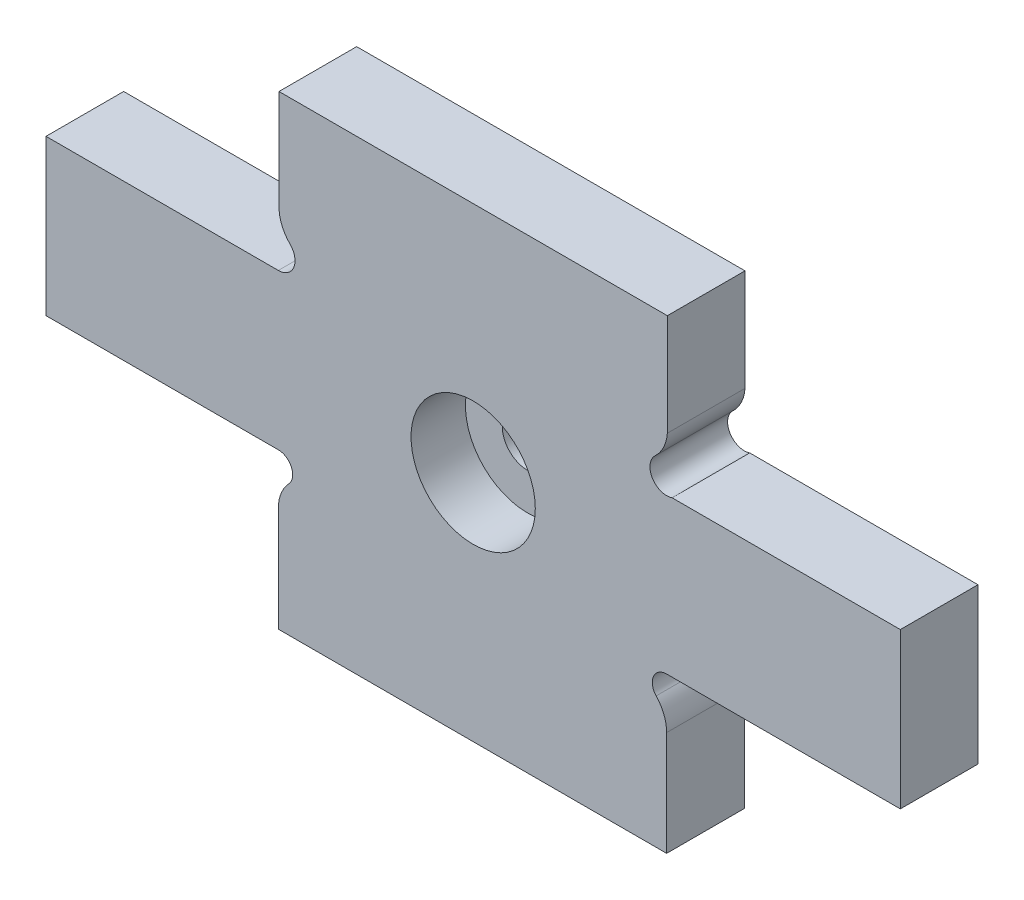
ISO-10303-21;
HEADER;
FILE_DESCRIPTION(('STEP AP214'),'2;1');
FILE_NAME('part.step','',(''),(''),'','','');
FILE_SCHEMA(('AUTOMOTIVE_DESIGN { 1 0 10303 214 1 1 1 1 }'));
ENDSEC;
DATA;
#1=APPLICATION_CONTEXT('core data for automotive mechanical design processes');
#2=APPLICATION_PROTOCOL_DEFINITION('international standard','automotive_design',2000,#1);
#3=PRODUCT_CONTEXT('',#1,'mechanical');
#4=PRODUCT('Part','Part','',(#3));
#5=PRODUCT_RELATED_PRODUCT_CATEGORY('part','',(#4));
#6=PRODUCT_DEFINITION_FORMATION('','',#4);
#7=PRODUCT_DEFINITION_CONTEXT('part definition',#1,'design');
#8=PRODUCT_DEFINITION('design','',#6,#7);
#9=PRODUCT_DEFINITION_SHAPE('','',#8);
#10=(LENGTH_UNIT() NAMED_UNIT(*) SI_UNIT(.MILLI.,.METRE.));
#11=(NAMED_UNIT(*) PLANE_ANGLE_UNIT() SI_UNIT($,.RADIAN.));
#12=(NAMED_UNIT(*) SI_UNIT($,.STERADIAN.) SOLID_ANGLE_UNIT());
#13=UNCERTAINTY_MEASURE_WITH_UNIT(LENGTH_MEASURE(1.E-05),#10,'distance_accuracy_value','');
#14=(GEOMETRIC_REPRESENTATION_CONTEXT(3) GLOBAL_UNCERTAINTY_ASSIGNED_CONTEXT((#13)) GLOBAL_UNIT_ASSIGNED_CONTEXT((#10,
#11,#12)) REPRESENTATION_CONTEXT('',''));
#15=CARTESIAN_POINT('',(0.,0.,0.));
#16=DIRECTION('',(0.,0.,1.));
#17=DIRECTION('',(1.,0.,0.));
#18=AXIS2_PLACEMENT_3D('',#15,#16,#17);
#19=CARTESIAN_POINT('',(0.,0.,10.));
#20=DIRECTION('',(0.,0.,-1.));
#21=DIRECTION('',(-1.,0.,0.));
#22=AXIS2_PLACEMENT_3D('',#19,#20,#21);
#23=CYLINDRICAL_SURFACE('',#22,3.25);
#24=CARTESIAN_POINT('',(0.,0.,0.));
#25=DIRECTION('',(0.,0.,1.));
#26=DIRECTION('',(1.,0.,0.));
#27=AXIS2_PLACEMENT_3D('',#24,#25,#26);
#28=CIRCLE('',#27,3.25);
#29=CARTESIAN_POINT('',(3.25,0.,0.));
#30=VERTEX_POINT('',#29);
#31=EDGE_CURVE('E225',#30,#30,#28,.T.);
#32=ORIENTED_EDGE('',*,*,#31,.F.);
#33=EDGE_LOOP('',(#32));
#34=FACE_BOUND('',#33,.T.);
#35=CARTESIAN_POINT('',(0.,0.,3.));
#36=DIRECTION('',(0.,0.,1.));
#37=DIRECTION('',(1.,0.,0.));
#38=AXIS2_PLACEMENT_3D('',#35,#36,#37);
#39=CIRCLE('',#38,3.25);
#40=CARTESIAN_POINT('',(3.25,0.,3.));
#41=VERTEX_POINT('',#40);
#42=EDGE_CURVE('E49',#41,#41,#39,.T.);
#43=ORIENTED_EDGE('',*,*,#42,.T.);
#44=EDGE_LOOP('',(#43));
#45=FACE_BOUND('',#44,.T.);
#46=ADVANCED_FACE('F45',(#34,#45),#23,.F.);
#47=CARTESIAN_POINT('',(19.9125190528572,-16.5321469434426,10.));
#48=DIRECTION('',(0.,0.,-1.));
#49=DIRECTION('',(-1.,0.,0.));
#50=AXIS2_PLACEMENT_3D('',#47,#48,#49);
#51=CYLINDRICAL_SURFACE('',#50,4.99999999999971);
#52=CARTESIAN_POINT('',(19.9125190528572,-16.5321469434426,0.));
#53=DIRECTION('',(0.,0.,1.));
#54=DIRECTION('',(1.,0.,0.));
#55=AXIS2_PLACEMENT_3D('',#52,#53,#54);
#56=CIRCLE('',#55,4.99999999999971);
#57=CARTESIAN_POINT('',(24.9125190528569,-16.5321469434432,0.));
#58=VERTEX_POINT('',#57);
#59=CARTESIAN_POINT('',(23.5621540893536,-13.1145214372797,0.));
#60=VERTEX_POINT('',#59);
#61=EDGE_CURVE('E220',#58,#60,#56,.T.);
#62=ORIENTED_EDGE('',*,*,#61,.T.);
#63=DIRECTION('',(0.,0.,-1.));
#64=VECTOR('',#63,1.);
#65=CARTESIAN_POINT('',(23.5621540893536,-13.1145214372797,10.));
#66=LINE('',#65,#64);
#67=CARTESIAN_POINT('',(23.5621540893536,-13.1145214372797,10.));
#68=VERTEX_POINT('',#67);
#69=EDGE_CURVE('E11',#68,#60,#66,.T.);
#70=ORIENTED_EDGE('',*,*,#69,.F.);
#71=CARTESIAN_POINT('',(19.9125190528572,-16.5321469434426,10.));
#72=DIRECTION('',(0.,0.,1.));
#73=DIRECTION('',(1.,0.,0.));
#74=AXIS2_PLACEMENT_3D('',#71,#72,#73);
#75=CIRCLE('',#74,4.99999999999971);
#76=CARTESIAN_POINT('',(24.9125190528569,-16.5321469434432,10.));
#77=VERTEX_POINT('',#76);
#78=EDGE_CURVE('E279',#77,#68,#75,.T.);
#79=ORIENTED_EDGE('',*,*,#78,.F.);
#80=DIRECTION('',(0.,0.,-1.));
#81=VECTOR('',#80,1.);
#82=CARTESIAN_POINT('',(24.9125190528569,-16.5321469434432,10.));
#83=LINE('',#82,#81);
#84=EDGE_CURVE('E216',#77,#58,#83,.T.);
#85=ORIENTED_EDGE('',*,*,#84,.T.);
#86=EDGE_LOOP('',(#62,#70,#79,#85));
#87=FACE_BOUND('',#86,.T.);
#88=ADVANCED_FACE('F47',(#87),#51,.T.);
#89=CARTESIAN_POINT('',(24.9125190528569,-11.8499999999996,10.));
#90=DIRECTION('',(0.,0.,-1.));
#91=DIRECTION('',(-1.,0.,0.));
#92=AXIS2_PLACEMENT_3D('',#89,#90,#91);
#93=CYLINDRICAL_SURFACE('',#92,1.84999999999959);
#94=CARTESIAN_POINT('',(24.9125190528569,-11.8499999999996,0.));
#95=DIRECTION('',(0.,0.,-1.));
#96=DIRECTION('',(1.,0.,0.));
#97=AXIS2_PLACEMENT_3D('',#94,#95,#96);
#98=CIRCLE('',#97,1.84999999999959);
#99=CARTESIAN_POINT('',(24.9125190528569,-10.,0.));
#100=VERTEX_POINT('',#99);
#101=EDGE_CURVE('E224',#60,#100,#98,.T.);
#102=ORIENTED_EDGE('',*,*,#101,.T.);
#103=DIRECTION('',(0.,0.,-1.));
#104=VECTOR('',#103,1.);
#105=CARTESIAN_POINT('',(24.9125190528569,-10.,10.));
#106=LINE('',#105,#104);
#107=CARTESIAN_POINT('',(24.9125190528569,-10.,10.));
#108=VERTEX_POINT('',#107);
#109=EDGE_CURVE('E56',#108,#100,#106,.T.);
#110=ORIENTED_EDGE('',*,*,#109,.F.);
#111=CARTESIAN_POINT('',(24.9125190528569,-11.8499999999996,10.));
#112=DIRECTION('',(0.,0.,-1.));
#113=DIRECTION('',(1.,0.,0.));
#114=AXIS2_PLACEMENT_3D('',#111,#112,#113);
#115=CIRCLE('',#114,1.84999999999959);
#116=EDGE_CURVE('E143',#68,#108,#115,.T.);
#117=ORIENTED_EDGE('',*,*,#116,.F.);
#118=ORIENTED_EDGE('',*,*,#69,.T.);
#119=EDGE_LOOP('',(#102,#110,#117,#118));
#120=FACE_BOUND('',#119,.T.);
#121=ADVANCED_FACE('F437',(#120),#93,.F.);
#122=CARTESIAN_POINT('',(24.9125190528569,-10.,10.));
#123=DIRECTION('',(0.,1.,0.));
#124=DIRECTION('',(-1.,0.,0.));
#125=AXIS2_PLACEMENT_3D('',#122,#123,#124);
#126=PLANE('',#125);
#127=DIRECTION('',(1.,0.,0.));
#128=VECTOR('',#127,1.);
#129=CARTESIAN_POINT('',(24.9125190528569,-10.,0.));
#130=LINE('',#129,#128);
#131=CARTESIAN_POINT('',(55.0000000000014,-9.99999999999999,0.));
#132=VERTEX_POINT('',#131);
#133=EDGE_CURVE('E228',#100,#132,#130,.T.);
#134=ORIENTED_EDGE('',*,*,#133,.T.);
#135=DIRECTION('',(0.,0.,-1.));
#136=VECTOR('',#135,1.);
#137=CARTESIAN_POINT('',(55.0000000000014,-9.99999999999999,10.));
#138=LINE('',#137,#136);
#139=CARTESIAN_POINT('',(55.0000000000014,-9.99999999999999,10.));
#140=VERTEX_POINT('',#139);
#141=EDGE_CURVE('E338',#140,#132,#138,.T.);
#142=ORIENTED_EDGE('',*,*,#141,.F.);
#143=DIRECTION('',(1.,0.,0.));
#144=VECTOR('',#143,1.);
#145=CARTESIAN_POINT('',(24.9125190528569,-10.,10.));
#146=LINE('',#145,#144);
#147=EDGE_CURVE('E349',#108,#140,#146,.T.);
#148=ORIENTED_EDGE('',*,*,#147,.F.);
#149=ORIENTED_EDGE('',*,*,#109,.T.);
#150=EDGE_LOOP('',(#134,#142,#148,#149));
#151=FACE_BOUND('',#150,.T.);
#152=ADVANCED_FACE('F347',(#151),#126,.F.);
#153=CARTESIAN_POINT('',(55.0000000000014,-9.99999999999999,10.));
#154=DIRECTION('',(-1.,0.,0.));
#155=DIRECTION('',(0.,-1.,0.));
#156=AXIS2_PLACEMENT_3D('',#153,#154,#155);
#157=PLANE('',#156);
#158=DIRECTION('',(0.,1.,0.));
#159=VECTOR('',#158,1.);
#160=CARTESIAN_POINT('',(55.0000000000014,-9.99999999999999,0.));
#161=LINE('',#160,#159);
#162=CARTESIAN_POINT('',(55.0000000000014,10.,0.));
#163=VERTEX_POINT('',#162);
#164=EDGE_CURVE('E231',#132,#163,#161,.T.);
#165=ORIENTED_EDGE('',*,*,#164,.T.);
#166=DIRECTION('',(0.,0.,-1.));
#167=VECTOR('',#166,1.);
#168=CARTESIAN_POINT('',(55.0000000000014,10.,10.));
#169=LINE('',#168,#167);
#170=CARTESIAN_POINT('',(55.0000000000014,10.,10.));
#171=VERTEX_POINT('',#170);
#172=EDGE_CURVE('E334',#171,#163,#169,.T.);
#173=ORIENTED_EDGE('',*,*,#172,.F.);
#174=DIRECTION('',(0.,1.,0.));
#175=VECTOR('',#174,1.);
#176=CARTESIAN_POINT('',(55.0000000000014,-9.99999999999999,10.));
#177=LINE('',#176,#175);
#178=EDGE_CURVE('E368',#140,#171,#177,.T.);
#179=ORIENTED_EDGE('',*,*,#178,.F.);
#180=ORIENTED_EDGE('',*,*,#141,.T.);
#181=EDGE_LOOP('',(#165,#173,#179,#180));
#182=FACE_BOUND('',#181,.T.);
#183=ADVANCED_FACE('F358',(#182),#157,.F.);
#184=CARTESIAN_POINT('',(55.0000000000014,10.,10.));
#185=DIRECTION('',(0.,-1.,0.));
#186=DIRECTION('',(1.,0.,0.));
#187=AXIS2_PLACEMENT_3D('',#184,#185,#186);
#188=PLANE('',#187);
#189=DIRECTION('',(-1.,0.,0.));
#190=VECTOR('',#189,1.);
#191=CARTESIAN_POINT('',(55.0000000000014,10.,0.));
#192=LINE('',#191,#190);
#193=CARTESIAN_POINT('',(25.6054544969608,10.,0.));
#194=VERTEX_POINT('',#193);
#195=EDGE_CURVE('E234',#163,#194,#192,.T.);
#196=ORIENTED_EDGE('',*,*,#195,.T.);
#197=DIRECTION('',(0.,0.,-1.));
#198=VECTOR('',#197,1.);
#199=CARTESIAN_POINT('',(25.6054544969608,10.,10.));
#200=LINE('',#199,#198);
#201=CARTESIAN_POINT('',(25.6054544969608,10.,10.));
#202=VERTEX_POINT('',#201);
#203=EDGE_CURVE('E330',#202,#194,#200,.T.);
#204=ORIENTED_EDGE('',*,*,#203,.F.);
#205=DIRECTION('',(-1.,0.,0.));
#206=VECTOR('',#205,1.);
#207=CARTESIAN_POINT('',(55.0000000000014,10.,10.));
#208=LINE('',#207,#206);
#209=EDGE_CURVE('E364',#171,#202,#208,.T.);
#210=ORIENTED_EDGE('',*,*,#209,.F.);
#211=ORIENTED_EDGE('',*,*,#172,.T.);
#212=EDGE_LOOP('',(#196,#204,#210,#211));
#213=FACE_BOUND('',#212,.T.);
#214=ADVANCED_FACE('F362',(#213),#188,.F.);
#215=CARTESIAN_POINT('',(24.9125190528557,12.0392494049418,10.));
#216=DIRECTION('',(0.,0.,-1.));
#217=DIRECTION('',(-1.,0.,0.));
#218=AXIS2_PLACEMENT_3D('',#215,#216,#217);
#219=CYLINDRICAL_SURFACE('',#218,2.15376360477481);
#220=CARTESIAN_POINT('',(24.9125190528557,12.0392494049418,0.));
#221=DIRECTION('',(0.,0.,-1.));
#222=DIRECTION('',(1.,0.,0.));
#223=AXIS2_PLACEMENT_3D('',#220,#221,#222);
#224=CIRCLE('',#223,2.15376360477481);
#225=CARTESIAN_POINT('',(23.4920014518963,13.658146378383,0.));
#226=VERTEX_POINT('',#225);
#227=EDGE_CURVE('E237',#194,#226,#224,.T.);
#228=ORIENTED_EDGE('',*,*,#227,.T.);
#229=DIRECTION('',(0.,0.,-1.));
#230=VECTOR('',#229,1.);
#231=CARTESIAN_POINT('',(23.4920014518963,13.658146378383,10.));
#232=LINE('',#231,#230);
#233=CARTESIAN_POINT('',(23.4920014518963,13.658146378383,10.));
#234=VERTEX_POINT('',#233);
#235=EDGE_CURVE('E326',#234,#226,#232,.T.);
#236=ORIENTED_EDGE('',*,*,#235,.F.);
#237=CARTESIAN_POINT('',(24.9125190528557,12.0392494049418,10.));
#238=DIRECTION('',(0.,0.,-1.));
#239=DIRECTION('',(1.,0.,0.));
#240=AXIS2_PLACEMENT_3D('',#237,#238,#239);
#241=CIRCLE('',#240,2.15376360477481);
#242=EDGE_CURVE('E367',#202,#234,#241,.T.);
#243=ORIENTED_EDGE('',*,*,#242,.F.);
#244=ORIENTED_EDGE('',*,*,#203,.T.);
#245=EDGE_LOOP('',(#228,#236,#243,#244));
#246=FACE_BOUND('',#245,.T.);
#247=ADVANCED_FACE('F621',(#246),#219,.F.);
#248=CARTESIAN_POINT('',(20.0124530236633,17.2487929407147,10.));
#249=DIRECTION('',(0.,0.,-1.));
#250=DIRECTION('',(-1.,0.,0.));
#251=AXIS2_PLACEMENT_3D('',#248,#249,#250);
#252=CYLINDRICAL_SURFACE('',#251,5.00000000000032);
#253=CARTESIAN_POINT('',(20.0124530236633,17.2487929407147,0.));
#254=DIRECTION('',(0.,0.,1.));
#255=DIRECTION('',(1.,0.,0.));
#256=AXIS2_PLACEMENT_3D('',#253,#254,#255);
#257=CIRCLE('',#256,5.00000000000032);
#258=CARTESIAN_POINT('',(25.0000000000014,16.8961243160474,0.));
#259=VERTEX_POINT('',#258);
#260=EDGE_CURVE('E240',#226,#259,#257,.T.);
#261=ORIENTED_EDGE('',*,*,#260,.T.);
#262=DIRECTION('',(0.,0.,-1.));
#263=VECTOR('',#262,1.);
#264=CARTESIAN_POINT('',(25.0000000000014,16.8961243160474,10.));
#265=LINE('',#264,#263);
#266=CARTESIAN_POINT('',(25.0000000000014,16.8961243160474,10.));
#267=VERTEX_POINT('',#266);
#268=EDGE_CURVE('E322',#267,#259,#265,.T.);
#269=ORIENTED_EDGE('',*,*,#268,.F.);
#270=CARTESIAN_POINT('',(20.0124530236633,17.2487929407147,10.));
#271=DIRECTION('',(0.,0.,1.));
#272=DIRECTION('',(1.,0.,0.));
#273=AXIS2_PLACEMENT_3D('',#270,#271,#272);
#274=CIRCLE('',#273,5.00000000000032);
#275=EDGE_CURVE('E372',#234,#267,#274,.T.);
#276=ORIENTED_EDGE('',*,*,#275,.F.);
#277=ORIENTED_EDGE('',*,*,#235,.T.);
#278=EDGE_LOOP('',(#261,#269,#276,#277));
#279=FACE_BOUND('',#278,.T.);
#280=ADVANCED_FACE('F611',(#279),#252,.T.);
#281=CARTESIAN_POINT('',(25.0000000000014,16.8961243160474,10.));
#282=DIRECTION('',(-1.,0.,0.));
#283=DIRECTION('',(0.,0.,1.));
#284=AXIS2_PLACEMENT_3D('',#281,#282,#283);
#285=PLANE('',#284);
#286=DIRECTION('',(0.,1.,0.));
#287=VECTOR('',#286,1.);
#288=CARTESIAN_POINT('',(25.0000000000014,16.8961243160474,0.));
#289=LINE('',#288,#287);
#290=CARTESIAN_POINT('',(25.0000000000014,30.,0.));
#291=VERTEX_POINT('',#290);
#292=EDGE_CURVE('E243',#259,#291,#289,.T.);
#293=ORIENTED_EDGE('',*,*,#292,.T.);
#294=DIRECTION('',(0.,0.,-1.));
#295=VECTOR('',#294,1.);
#296=CARTESIAN_POINT('',(25.0000000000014,30.,10.));
#297=LINE('',#296,#295);
#298=CARTESIAN_POINT('',(25.0000000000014,30.,10.));
#299=VERTEX_POINT('',#298);
#300=EDGE_CURVE('E318',#299,#291,#297,.T.);
#301=ORIENTED_EDGE('',*,*,#300,.F.);
#302=DIRECTION('',(0.,1.,0.));
#303=VECTOR('',#302,1.);
#304=CARTESIAN_POINT('',(25.0000000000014,16.8961243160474,10.));
#305=LINE('',#304,#303);
#306=EDGE_CURVE('E379',#267,#299,#305,.T.);
#307=ORIENTED_EDGE('',*,*,#306,.F.);
#308=ORIENTED_EDGE('',*,*,#268,.T.);
#309=EDGE_LOOP('',(#293,#301,#307,#308));
#310=FACE_BOUND('',#309,.T.);
#311=ADVANCED_FACE('F601',(#310),#285,.F.);
#312=CARTESIAN_POINT('',(25.0000000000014,30.,10.));
#313=DIRECTION('',(0.,-1.,0.));
#314=DIRECTION('',(1.,0.,0.));
#315=AXIS2_PLACEMENT_3D('',#312,#313,#314);
#316=PLANE('',#315);
#317=DIRECTION('',(-1.,0.,0.));
#318=VECTOR('',#317,1.);
#319=CARTESIAN_POINT('',(25.0000000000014,30.,0.));
#320=LINE('',#319,#318);
#321=CARTESIAN_POINT('',(-25.,30.,0.));
#322=VERTEX_POINT('',#321);
#323=EDGE_CURVE('E246',#291,#322,#320,.T.);
#324=ORIENTED_EDGE('',*,*,#323,.T.);
#325=DIRECTION('',(0.,0.,-1.));
#326=VECTOR('',#325,1.);
#327=CARTESIAN_POINT('',(-25.,30.,10.));
#328=LINE('',#327,#326);
#329=CARTESIAN_POINT('',(-25.,30.,10.));
#330=VERTEX_POINT('',#329);
#331=EDGE_CURVE('E314',#330,#322,#328,.T.);
#332=ORIENTED_EDGE('',*,*,#331,.F.);
#333=DIRECTION('',(-1.,0.,0.));
#334=VECTOR('',#333,1.);
#335=CARTESIAN_POINT('',(25.0000000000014,30.,10.));
#336=LINE('',#335,#334);
#337=EDGE_CURVE('E382',#299,#330,#336,.T.);
#338=ORIENTED_EDGE('',*,*,#337,.F.);
#339=ORIENTED_EDGE('',*,*,#300,.T.);
#340=EDGE_LOOP('',(#324,#332,#338,#339));
#341=FACE_BOUND('',#340,.T.);
#342=ADVANCED_FACE('F591',(#341),#316,.F.);
#343=CARTESIAN_POINT('',(-25.,30.,10.));
#344=DIRECTION('',(1.,0.,0.));
#345=DIRECTION('',(0.,1.,0.));
#346=AXIS2_PLACEMENT_3D('',#343,#344,#345);
#347=PLANE('',#346);
#348=DIRECTION('',(0.,-1.,0.));
#349=VECTOR('',#348,1.);
#350=CARTESIAN_POINT('',(-25.,30.,0.));
#351=LINE('',#350,#349);
#352=CARTESIAN_POINT('',(-25.,16.8961243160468,0.));
#353=VERTEX_POINT('',#352);
#354=EDGE_CURVE('E249',#322,#353,#351,.T.);
#355=ORIENTED_EDGE('',*,*,#354,.T.);
#356=DIRECTION('',(0.,0.,-1.));
#357=VECTOR('',#356,1.);
#358=CARTESIAN_POINT('',(-25.,16.8961243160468,10.));
#359=LINE('',#358,#357);
#360=CARTESIAN_POINT('',(-25.,16.8961243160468,10.));
#361=VERTEX_POINT('',#360);
#362=EDGE_CURVE('E310',#361,#353,#359,.T.);
#363=ORIENTED_EDGE('',*,*,#362,.F.);
#364=DIRECTION('',(0.,-1.,0.));
#365=VECTOR('',#364,1.);
#366=CARTESIAN_POINT('',(-25.,30.,10.));
#367=LINE('',#366,#365);
#368=EDGE_CURVE('E385',#330,#361,#367,.T.);
#369=ORIENTED_EDGE('',*,*,#368,.F.);
#370=ORIENTED_EDGE('',*,*,#331,.T.);
#371=EDGE_LOOP('',(#355,#363,#369,#370));
#372=FACE_BOUND('',#371,.T.);
#373=ADVANCED_FACE('F581',(#372),#347,.F.);
#374=CARTESIAN_POINT('',(-20.0080886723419,17.1804151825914,10.));
#375=DIRECTION('',(0.,0.,-1.));
#376=DIRECTION('',(-1.,0.,0.));
#377=AXIS2_PLACEMENT_3D('',#374,#375,#376);
#378=CYLINDRICAL_SURFACE('',#377,5.00000000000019);
#379=CARTESIAN_POINT('',(-20.0080886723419,17.1804151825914,0.));
#380=DIRECTION('',(0.,0.,1.));
#381=DIRECTION('',(1.,0.,0.));
#382=AXIS2_PLACEMENT_3D('',#379,#380,#381);
#383=CIRCLE('',#382,5.00000000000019);
#384=CARTESIAN_POINT('',(-23.5181378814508,13.6195789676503,0.));
#385=VERTEX_POINT('',#384);
#386=EDGE_CURVE('E252',#353,#385,#383,.T.);
#387=ORIENTED_EDGE('',*,*,#386,.T.);
#388=DIRECTION('',(0.,0.,-1.));
#389=VECTOR('',#388,1.);
#390=CARTESIAN_POINT('',(-23.5181378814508,13.6195789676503,10.));
#391=LINE('',#390,#389);
#392=CARTESIAN_POINT('',(-23.5181378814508,13.6195789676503,10.));
#393=VERTEX_POINT('',#392);
#394=EDGE_CURVE('E306',#393,#385,#391,.T.);
#395=ORIENTED_EDGE('',*,*,#394,.F.);
#396=CARTESIAN_POINT('',(-20.0080886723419,17.1804151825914,10.));
#397=DIRECTION('',(0.,0.,1.));
#398=DIRECTION('',(1.,0.,0.));
#399=AXIS2_PLACEMENT_3D('',#396,#397,#398);
#400=CIRCLE('',#399,5.00000000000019);
#401=EDGE_CURVE('E388',#361,#393,#400,.T.);
#402=ORIENTED_EDGE('',*,*,#401,.F.);
#403=ORIENTED_EDGE('',*,*,#362,.T.);
#404=EDGE_LOOP('',(#387,#395,#402,#403));
#405=FACE_BOUND('',#404,.T.);
#406=ADVANCED_FACE('F571',(#405),#378,.T.);
#407=CARTESIAN_POINT('',(-25.0874809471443,12.1500000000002,10.));
#408=DIRECTION('',(0.,0.,-1.));
#409=DIRECTION('',(-1.,0.,0.));
#410=AXIS2_PLACEMENT_3D('',#407,#408,#409);
#411=CYLINDRICAL_SURFACE('',#410,2.14999999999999);
#412=CARTESIAN_POINT('',(-25.0874809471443,12.1500000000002,0.));
#413=DIRECTION('',(0.,0.,-1.));
#414=DIRECTION('',(1.,0.,0.));
#415=AXIS2_PLACEMENT_3D('',#412,#413,#414);
#416=CIRCLE('',#415,2.14999999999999);
#417=CARTESIAN_POINT('',(-25.0874809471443,10.0000000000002,0.));
#418=VERTEX_POINT('',#417);
#419=EDGE_CURVE('E255',#385,#418,#416,.T.);
#420=ORIENTED_EDGE('',*,*,#419,.T.);
#421=DIRECTION('',(0.,0.,-1.));
#422=VECTOR('',#421,1.);
#423=CARTESIAN_POINT('',(-25.0874809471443,10.0000000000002,10.));
#424=LINE('',#423,#422);
#425=CARTESIAN_POINT('',(-25.0874809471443,10.0000000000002,10.));
#426=VERTEX_POINT('',#425);
#427=EDGE_CURVE('E302',#426,#418,#424,.T.);
#428=ORIENTED_EDGE('',*,*,#427,.F.);
#429=CARTESIAN_POINT('',(-25.0874809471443,12.1500000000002,10.));
#430=DIRECTION('',(0.,0.,-1.));
#431=DIRECTION('',(1.,0.,0.));
#432=AXIS2_PLACEMENT_3D('',#429,#430,#431);
#433=CIRCLE('',#432,2.14999999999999);
#434=EDGE_CURVE('E391',#393,#426,#433,.T.);
#435=ORIENTED_EDGE('',*,*,#434,.F.);
#436=ORIENTED_EDGE('',*,*,#394,.T.);
#437=EDGE_LOOP('',(#420,#428,#435,#436));
#438=FACE_BOUND('',#437,.T.);
#439=ADVANCED_FACE('F561',(#438),#411,.F.);
#440=CARTESIAN_POINT('',(-25.0874809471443,10.0000000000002,10.));
#441=DIRECTION('',(0.,-1.,0.));
#442=DIRECTION('',(0.,0.,-1.));
#443=AXIS2_PLACEMENT_3D('',#440,#441,#442);
#444=PLANE('',#443);
#445=DIRECTION('',(-1.,0.,0.));
#446=VECTOR('',#445,1.);
#447=CARTESIAN_POINT('',(-25.0874809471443,10.0000000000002,0.));
#448=LINE('',#447,#446);
#449=CARTESIAN_POINT('',(-55.,10.0000000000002,0.));
#450=VERTEX_POINT('',#449);
#451=EDGE_CURVE('E258',#418,#450,#448,.T.);
#452=ORIENTED_EDGE('',*,*,#451,.T.);
#453=DIRECTION('',(0.,0.,-1.));
#454=VECTOR('',#453,1.);
#455=CARTESIAN_POINT('',(-55.,10.0000000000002,10.));
#456=LINE('',#455,#454);
#457=CARTESIAN_POINT('',(-55.,10.0000000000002,10.));
#458=VERTEX_POINT('',#457);
#459=EDGE_CURVE('E298',#458,#450,#456,.T.);
#460=ORIENTED_EDGE('',*,*,#459,.F.);
#461=DIRECTION('',(-1.,0.,0.));
#462=VECTOR('',#461,1.);
#463=CARTESIAN_POINT('',(-25.0874809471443,10.0000000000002,10.));
#464=LINE('',#463,#462);
#465=EDGE_CURVE('E394',#426,#458,#464,.T.);
#466=ORIENTED_EDGE('',*,*,#465,.F.);
#467=ORIENTED_EDGE('',*,*,#427,.T.);
#468=EDGE_LOOP('',(#452,#460,#466,#467));
#469=FACE_BOUND('',#468,.T.);
#470=ADVANCED_FACE('F551',(#469),#444,.F.);
#471=CARTESIAN_POINT('',(-55.,10.0000000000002,10.));
#472=DIRECTION('',(1.,0.,0.));
#473=DIRECTION('',(0.,0.,-1.));
#474=AXIS2_PLACEMENT_3D('',#471,#472,#473);
#475=PLANE('',#474);
#476=DIRECTION('',(0.,-1.,0.));
#477=VECTOR('',#476,1.);
#478=CARTESIAN_POINT('',(-55.,10.0000000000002,0.));
#479=LINE('',#478,#477);
#480=CARTESIAN_POINT('',(-55.,-9.99999999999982,0.));
#481=VERTEX_POINT('',#480);
#482=EDGE_CURVE('E261',#450,#481,#479,.T.);
#483=ORIENTED_EDGE('',*,*,#482,.T.);
#484=DIRECTION('',(0.,0.,-1.));
#485=VECTOR('',#484,1.);
#486=CARTESIAN_POINT('',(-55.,-9.99999999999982,10.));
#487=LINE('',#486,#485);
#488=CARTESIAN_POINT('',(-55.,-9.99999999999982,10.));
#489=VERTEX_POINT('',#488);
#490=EDGE_CURVE('E294',#489,#481,#487,.T.);
#491=ORIENTED_EDGE('',*,*,#490,.F.);
#492=DIRECTION('',(0.,-1.,0.));
#493=VECTOR('',#492,1.);
#494=CARTESIAN_POINT('',(-55.,10.0000000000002,10.));
#495=LINE('',#494,#493);
#496=EDGE_CURVE('E397',#458,#489,#495,.T.);
#497=ORIENTED_EDGE('',*,*,#496,.F.);
#498=ORIENTED_EDGE('',*,*,#459,.T.);
#499=EDGE_LOOP('',(#483,#491,#497,#498));
#500=FACE_BOUND('',#499,.T.);
#501=ADVANCED_FACE('F541',(#500),#475,.F.);
#502=CARTESIAN_POINT('',(-55.,-9.99999999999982,10.));
#503=DIRECTION('',(0.,1.,0.));
#504=DIRECTION('',(-1.,0.,0.));
#505=AXIS2_PLACEMENT_3D('',#502,#503,#504);
#506=PLANE('',#505);
#507=DIRECTION('',(1.,0.,0.));
#508=VECTOR('',#507,1.);
#509=CARTESIAN_POINT('',(-55.,-9.99999999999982,0.));
#510=LINE('',#509,#508);
#511=CARTESIAN_POINT('',(-25.0874809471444,-9.99999999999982,0.));
#512=VERTEX_POINT('',#511);
#513=EDGE_CURVE('E264',#481,#512,#510,.T.);
#514=ORIENTED_EDGE('',*,*,#513,.T.);
#515=DIRECTION('',(0.,0.,-1.));
#516=VECTOR('',#515,1.);
#517=CARTESIAN_POINT('',(-25.0874809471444,-9.99999999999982,10.));
#518=LINE('',#517,#516);
#519=CARTESIAN_POINT('',(-25.0874809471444,-9.99999999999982,10.));
#520=VERTEX_POINT('',#519);
#521=EDGE_CURVE('E290',#520,#512,#518,.T.);
#522=ORIENTED_EDGE('',*,*,#521,.F.);
#523=DIRECTION('',(1.,0.,0.));
#524=VECTOR('',#523,1.);
#525=CARTESIAN_POINT('',(-55.,-9.99999999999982,10.));
#526=LINE('',#525,#524);
#527=EDGE_CURVE('E400',#489,#520,#526,.T.);
#528=ORIENTED_EDGE('',*,*,#527,.F.);
#529=ORIENTED_EDGE('',*,*,#490,.T.);
#530=EDGE_LOOP('',(#514,#522,#528,#529));
#531=FACE_BOUND('',#530,.T.);
#532=ADVANCED_FACE('F532',(#531),#506,.F.);
#533=CARTESIAN_POINT('',(-25.0874809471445,-11.8499999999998,10.));
#534=DIRECTION('',(0.,0.,-1.));
#535=DIRECTION('',(-1.,0.,0.));
#536=AXIS2_PLACEMENT_3D('',#533,#534,#535);
#537=CYLINDRICAL_SURFACE('',#536,1.84999999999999);
#538=CARTESIAN_POINT('',(-25.0874809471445,-11.8499999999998,0.));
#539=DIRECTION('',(0.,0.,-1.));
#540=DIRECTION('',(1.,0.,0.));
#541=AXIS2_PLACEMENT_3D('',#538,#539,#540);
#542=CIRCLE('',#541,1.84999999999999);
#543=CARTESIAN_POINT('',(-23.7371159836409,-13.1145214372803,0.));
#544=VERTEX_POINT('',#543);
#545=EDGE_CURVE('E267',#512,#544,#542,.T.);
#546=ORIENTED_EDGE('',*,*,#545,.T.);
#547=DIRECTION('',(0.,0.,-1.));
#548=VECTOR('',#547,1.);
#549=CARTESIAN_POINT('',(-23.7371159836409,-13.1145214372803,10.));
#550=LINE('',#549,#548);
#551=CARTESIAN_POINT('',(-23.7371159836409,-13.1145214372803,10.));
#552=VERTEX_POINT('',#551);
#553=EDGE_CURVE('E286',#552,#544,#550,.T.);
#554=ORIENTED_EDGE('',*,*,#553,.F.);
#555=CARTESIAN_POINT('',(-25.0874809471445,-11.8499999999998,10.));
#556=DIRECTION('',(0.,0.,-1.));
#557=DIRECTION('',(1.,0.,0.));
#558=AXIS2_PLACEMENT_3D('',#555,#556,#557);
#559=CIRCLE('',#558,1.84999999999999);
#560=EDGE_CURVE('E403',#520,#552,#559,.T.);
#561=ORIENTED_EDGE('',*,*,#560,.F.);
#562=ORIENTED_EDGE('',*,*,#521,.T.);
#563=EDGE_LOOP('',(#546,#554,#561,#562));
#564=FACE_BOUND('',#563,.T.);
#565=ADVANCED_FACE('F411',(#564),#537,.F.);
#566=CARTESIAN_POINT('',(-20.0874809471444,-16.5321469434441,10.));
#567=DIRECTION('',(0.,0.,-1.));
#568=DIRECTION('',(-1.,0.,0.));
#569=AXIS2_PLACEMENT_3D('',#566,#567,#568);
#570=CYLINDRICAL_SURFACE('',#569,5.00000000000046);
#571=CARTESIAN_POINT('',(-20.0874809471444,-16.5321469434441,0.));
#572=DIRECTION('',(0.,0.,1.));
#573=DIRECTION('',(1.,0.,0.));
#574=AXIS2_PLACEMENT_3D('',#571,#572,#573);
#575=CIRCLE('',#574,5.00000000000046);
#576=CARTESIAN_POINT('',(-25.0874809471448,-16.5321469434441,0.));
#577=VERTEX_POINT('',#576);
#578=EDGE_CURVE('E270',#544,#577,#575,.T.);
#579=ORIENTED_EDGE('',*,*,#578,.T.);
#580=DIRECTION('',(0.,0.,-1.));
#581=VECTOR('',#580,1.);
#582=CARTESIAN_POINT('',(-25.0874809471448,-16.5321469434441,10.));
#583=LINE('',#582,#581);
#584=CARTESIAN_POINT('',(-25.0874809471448,-16.5321469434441,10.));
#585=VERTEX_POINT('',#584);
#586=EDGE_CURVE('E209',#585,#577,#583,.T.);
#587=ORIENTED_EDGE('',*,*,#586,.F.);
#588=CARTESIAN_POINT('',(-20.0874809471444,-16.5321469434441,10.));
#589=DIRECTION('',(0.,0.,1.));
#590=DIRECTION('',(1.,0.,0.));
#591=AXIS2_PLACEMENT_3D('',#588,#589,#590);
#592=CIRCLE('',#591,5.00000000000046);
#593=EDGE_CURVE('E198',#552,#585,#592,.T.);
#594=ORIENTED_EDGE('',*,*,#593,.F.);
#595=ORIENTED_EDGE('',*,*,#553,.T.);
#596=EDGE_LOOP('',(#579,#587,#594,#595));
#597=FACE_BOUND('',#596,.T.);
#598=ADVANCED_FACE('F415',(#597),#570,.T.);
#599=CARTESIAN_POINT('',(-25.0874809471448,-16.5321469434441,10.));
#600=DIRECTION('',(1.,0.,0.));
#601=DIRECTION('',(0.,1.,0.));
#602=AXIS2_PLACEMENT_3D('',#599,#600,#601);
#603=PLANE('',#602);
#604=DIRECTION('',(0.,-1.,0.));
#605=VECTOR('',#604,1.);
#606=CARTESIAN_POINT('',(-25.0874809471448,-16.5321469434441,0.));
#607=LINE('',#606,#605);
#608=CARTESIAN_POINT('',(-25.0874809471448,-29.9999999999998,0.));
#609=VERTEX_POINT('',#608);
#610=EDGE_CURVE('E207',#577,#609,#607,.T.);
#611=ORIENTED_EDGE('',*,*,#610,.T.);
#612=DIRECTION('',(0.,0.,-1.));
#613=VECTOR('',#612,1.);
#614=CARTESIAN_POINT('',(-25.0874809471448,-29.9999999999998,10.));
#615=LINE('',#614,#613);
#616=CARTESIAN_POINT('',(-25.0874809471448,-29.9999999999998,10.));
#617=VERTEX_POINT('',#616);
#618=EDGE_CURVE('E204',#617,#609,#615,.T.);
#619=ORIENTED_EDGE('',*,*,#618,.F.);
#620=DIRECTION('',(0.,-1.,0.));
#621=VECTOR('',#620,1.);
#622=CARTESIAN_POINT('',(-25.0874809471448,-16.5321469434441,10.));
#623=LINE('',#622,#621);
#624=EDGE_CURVE('E192',#585,#617,#623,.T.);
#625=ORIENTED_EDGE('',*,*,#624,.F.);
#626=ORIENTED_EDGE('',*,*,#586,.T.);
#627=EDGE_LOOP('',(#611,#619,#625,#626));
#628=FACE_BOUND('',#627,.T.);
#629=ADVANCED_FACE('F205',(#628),#603,.F.);
#630=CARTESIAN_POINT('',(-25.0874809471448,-29.9999999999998,10.));
#631=DIRECTION('',(0.,1.,0.));
#632=DIRECTION('',(-1.,0.,0.));
#633=AXIS2_PLACEMENT_3D('',#630,#631,#632);
#634=PLANE('',#633);
#635=DIRECTION('',(1.,0.,0.));
#636=VECTOR('',#635,1.);
#637=CARTESIAN_POINT('',(-25.0874809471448,-29.9999999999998,0.));
#638=LINE('',#637,#636);
#639=CARTESIAN_POINT('',(24.9125190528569,-29.9999999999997,0.));
#640=VERTEX_POINT('',#639);
#641=EDGE_CURVE('E129',#609,#640,#638,.T.);
#642=ORIENTED_EDGE('',*,*,#641,.T.);
#643=DIRECTION('',(0.,0.,-1.));
#644=VECTOR('',#643,1.);
#645=CARTESIAN_POINT('',(24.9125190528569,-29.9999999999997,10.));
#646=LINE('',#645,#644);
#647=CARTESIAN_POINT('',(24.9125190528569,-29.9999999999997,10.));
#648=VERTEX_POINT('',#647);
#649=EDGE_CURVE('E210',#648,#640,#646,.T.);
#650=ORIENTED_EDGE('',*,*,#649,.F.);
#651=DIRECTION('',(1.,0.,0.));
#652=VECTOR('',#651,1.);
#653=CARTESIAN_POINT('',(-25.0874809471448,-29.9999999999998,10.));
#654=LINE('',#653,#652);
#655=EDGE_CURVE('E196',#617,#648,#654,.T.);
#656=ORIENTED_EDGE('',*,*,#655,.F.);
#657=ORIENTED_EDGE('',*,*,#618,.T.);
#658=EDGE_LOOP('',(#642,#650,#656,#657));
#659=FACE_BOUND('',#658,.T.);
#660=ADVANCED_FACE('F212',(#659),#634,.F.);
#661=CARTESIAN_POINT('',(24.9125190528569,-29.9999999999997,10.));
#662=DIRECTION('',(-1.,0.,0.));
#663=DIRECTION('',(0.,0.,1.));
#664=AXIS2_PLACEMENT_3D('',#661,#662,#663);
#665=PLANE('',#664);
#666=DIRECTION('',(0.,1.,0.));
#667=VECTOR('',#666,1.);
#668=CARTESIAN_POINT('',(24.9125190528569,-29.9999999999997,0.));
#669=LINE('',#668,#667);
#670=EDGE_CURVE('E135',#640,#58,#669,.T.);
#671=ORIENTED_EDGE('',*,*,#670,.T.);
#672=ORIENTED_EDGE('',*,*,#84,.F.);
#673=DIRECTION('',(0.,1.,0.));
#674=VECTOR('',#673,1.);
#675=CARTESIAN_POINT('',(24.9125190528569,-29.9999999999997,10.));
#676=LINE('',#675,#674);
#677=EDGE_CURVE('E64',#648,#77,#676,.T.);
#678=ORIENTED_EDGE('',*,*,#677,.F.);
#679=ORIENTED_EDGE('',*,*,#649,.T.);
#680=EDGE_LOOP('',(#671,#672,#678,#679));
#681=FACE_BOUND('',#680,.T.);
#682=ADVANCED_FACE('F419',(#681),#665,.F.);
#683=CARTESIAN_POINT('',(19.9125190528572,-16.5321469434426,10.));
#684=DIRECTION('',(0.,0.,1.));
#685=DIRECTION('',(1.,0.,0.));
#686=AXIS2_PLACEMENT_3D('',#683,#684,#685);
#687=PLANE('',#686);
#688=CARTESIAN_POINT('',(0.,0.,10.));
#689=DIRECTION('',(0.,0.,1.));
#690=DIRECTION('',(1.,0.,0.));
#691=AXIS2_PLACEMENT_3D('',#688,#689,#690);
#692=CIRCLE('',#691,8.);
#693=CARTESIAN_POINT('',(8.,0.,10.));
#694=VERTEX_POINT('',#693);
#695=EDGE_CURVE('E457',#694,#694,#692,.T.);
#696=ORIENTED_EDGE('',*,*,#695,.F.);
#697=EDGE_LOOP('',(#696));
#698=FACE_BOUND('',#697,.T.);
#699=ORIENTED_EDGE('',*,*,#78,.T.);
#700=ORIENTED_EDGE('',*,*,#116,.T.);
#701=ORIENTED_EDGE('',*,*,#147,.T.);
#702=ORIENTED_EDGE('',*,*,#178,.T.);
#703=ORIENTED_EDGE('',*,*,#209,.T.);
#704=ORIENTED_EDGE('',*,*,#242,.T.);
#705=ORIENTED_EDGE('',*,*,#275,.T.);
#706=ORIENTED_EDGE('',*,*,#306,.T.);
#707=ORIENTED_EDGE('',*,*,#337,.T.);
#708=ORIENTED_EDGE('',*,*,#368,.T.);
#709=ORIENTED_EDGE('',*,*,#401,.T.);
#710=ORIENTED_EDGE('',*,*,#434,.T.);
#711=ORIENTED_EDGE('',*,*,#465,.T.);
#712=ORIENTED_EDGE('',*,*,#496,.T.);
#713=ORIENTED_EDGE('',*,*,#527,.T.);
#714=ORIENTED_EDGE('',*,*,#560,.T.);
#715=ORIENTED_EDGE('',*,*,#593,.T.);
#716=ORIENTED_EDGE('',*,*,#624,.T.);
#717=ORIENTED_EDGE('',*,*,#655,.T.);
#718=ORIENTED_EDGE('',*,*,#677,.T.);
#719=EDGE_LOOP('',(#699,#700,#701,#702,#703,#704,#705,#706,#707,#708,#709,#710,#711,#712,#713,
#714,#715,#716,#717,#718));
#720=FACE_BOUND('',#719,.T.);
#721=ADVANCED_FACE('F194',(#698,#720),#687,.T.);
#722=CARTESIAN_POINT('',(19.9125190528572,-16.5321469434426,0.));
#723=DIRECTION('',(0.,0.,1.));
#724=DIRECTION('',(1.,0.,0.));
#725=AXIS2_PLACEMENT_3D('',#722,#723,#724);
#726=PLANE('',#725);
#727=ORIENTED_EDGE('',*,*,#31,.T.);
#728=EDGE_LOOP('',(#727));
#729=FACE_BOUND('',#728,.T.);
#730=ORIENTED_EDGE('',*,*,#61,.F.);
#731=ORIENTED_EDGE('',*,*,#670,.F.);
#732=ORIENTED_EDGE('',*,*,#641,.F.);
#733=ORIENTED_EDGE('',*,*,#610,.F.);
#734=ORIENTED_EDGE('',*,*,#578,.F.);
#735=ORIENTED_EDGE('',*,*,#545,.F.);
#736=ORIENTED_EDGE('',*,*,#513,.F.);
#737=ORIENTED_EDGE('',*,*,#482,.F.);
#738=ORIENTED_EDGE('',*,*,#451,.F.);
#739=ORIENTED_EDGE('',*,*,#419,.F.);
#740=ORIENTED_EDGE('',*,*,#386,.F.);
#741=ORIENTED_EDGE('',*,*,#354,.F.);
#742=ORIENTED_EDGE('',*,*,#323,.F.);
#743=ORIENTED_EDGE('',*,*,#292,.F.);
#744=ORIENTED_EDGE('',*,*,#260,.F.);
#745=ORIENTED_EDGE('',*,*,#227,.F.);
#746=ORIENTED_EDGE('',*,*,#195,.F.);
#747=ORIENTED_EDGE('',*,*,#164,.F.);
#748=ORIENTED_EDGE('',*,*,#133,.F.);
#749=ORIENTED_EDGE('',*,*,#101,.F.);
#750=EDGE_LOOP('',(#730,#731,#732,#733,#734,#735,#736,#737,#738,#739,#740,#741,#742,#743,#744,
#745,#746,#747,#748,#749));
#751=FACE_BOUND('',#750,.T.);
#752=ADVANCED_FACE('F353',(#729,#751),#726,.F.);
#753=CARTESIAN_POINT('',(0.,0.,3.));
#754=DIRECTION('',(0.,0.,1.));
#755=DIRECTION('',(1.,0.,0.));
#756=AXIS2_PLACEMENT_3D('',#753,#754,#755);
#757=CYLINDRICAL_SURFACE('',#756,8.);
#758=CARTESIAN_POINT('',(0.,0.,3.));
#759=DIRECTION('',(0.,0.,1.));
#760=DIRECTION('',(1.,0.,0.));
#761=AXIS2_PLACEMENT_3D('',#758,#759,#760);
#762=CIRCLE('',#761,8.);
#763=CARTESIAN_POINT('',(8.,0.,3.));
#764=VERTEX_POINT('',#763);
#765=EDGE_CURVE('E454',#764,#764,#762,.T.);
#766=ORIENTED_EDGE('',*,*,#765,.F.);
#767=EDGE_LOOP('',(#766));
#768=FACE_BOUND('',#767,.T.);
#769=ORIENTED_EDGE('',*,*,#695,.T.);
#770=EDGE_LOOP('',(#769));
#771=FACE_BOUND('',#770,.T.);
#772=ADVANCED_FACE('F441',(#768,#771),#757,.F.);
#773=CARTESIAN_POINT('',(0.,0.,3.));
#774=DIRECTION('',(0.,0.,1.));
#775=DIRECTION('',(1.,0.,0.));
#776=AXIS2_PLACEMENT_3D('',#773,#774,#775);
#777=PLANE('',#776);
#778=ORIENTED_EDGE('',*,*,#42,.F.);
#779=EDGE_LOOP('',(#778));
#780=FACE_BOUND('',#779,.T.);
#781=ORIENTED_EDGE('',*,*,#765,.T.);
#782=EDGE_LOOP('',(#781));
#783=FACE_BOUND('',#782,.T.);
#784=ADVANCED_FACE('F447',(#780,#783),#777,.T.);
#785=CLOSED_SHELL('',(#46,#88,#121,#152,#183,#214,#247,#280,#311,#342,#373,#406,#439,#470,#501,
#532,#565,#598,#629,#660,#682,#721,#752,#772,#784));
#786=MANIFOLD_SOLID_BREP('B2',#785);
#787=ADVANCED_BREP_SHAPE_REPRESENTATION('',(#18,#786),#14);
#788=SHAPE_DEFINITION_REPRESENTATION(#9,#787);
ENDSEC;
END-ISO-10303-21;
